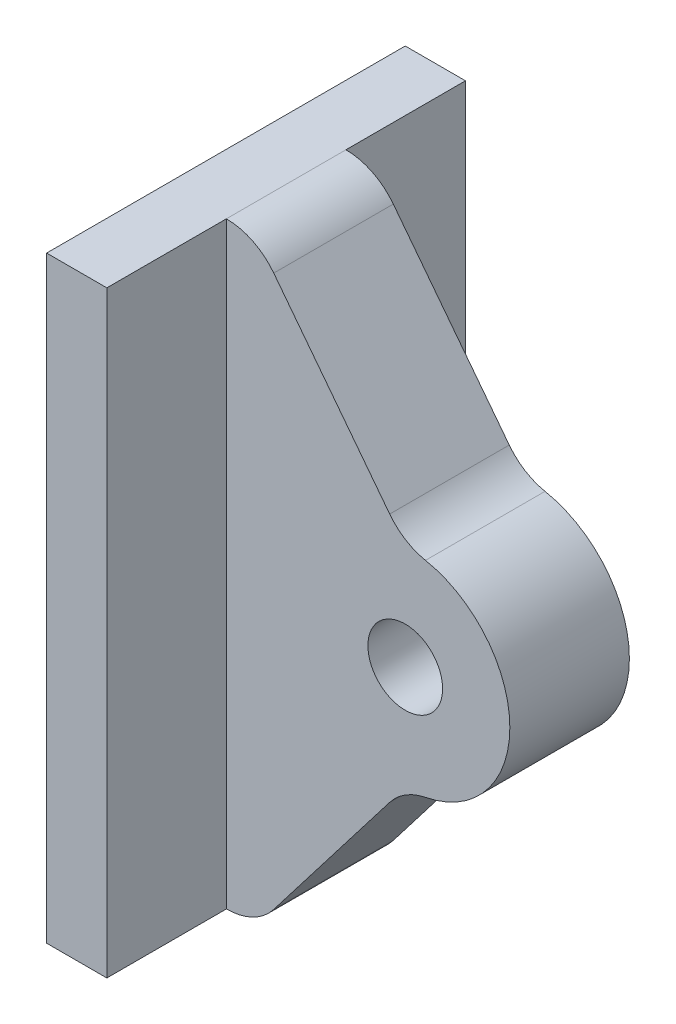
ISO-10303-21;
HEADER;
FILE_DESCRIPTION(('STEP AP214'),'2;1');
FILE_NAME('part.step','',(''),(''),'','','');
FILE_SCHEMA(('AUTOMOTIVE_DESIGN { 1 0 10303 214 1 1 1 1 }'));
ENDSEC;
DATA;
#1=APPLICATION_CONTEXT('core data for automotive mechanical design processes');
#2=APPLICATION_PROTOCOL_DEFINITION('international standard','automotive_design',2000,#1);
#3=PRODUCT_CONTEXT('',#1,'mechanical');
#4=PRODUCT('Part','Part','',(#3));
#5=PRODUCT_RELATED_PRODUCT_CATEGORY('part','',(#4));
#6=PRODUCT_DEFINITION_FORMATION('','',#4);
#7=PRODUCT_DEFINITION_CONTEXT('part definition',#1,'design');
#8=PRODUCT_DEFINITION('design','',#6,#7);
#9=PRODUCT_DEFINITION_SHAPE('','',#8);
#10=(LENGTH_UNIT() NAMED_UNIT(*) SI_UNIT(.MILLI.,.METRE.));
#11=(NAMED_UNIT(*) PLANE_ANGLE_UNIT() SI_UNIT($,.RADIAN.));
#12=(NAMED_UNIT(*) SI_UNIT($,.STERADIAN.) SOLID_ANGLE_UNIT());
#13=UNCERTAINTY_MEASURE_WITH_UNIT(LENGTH_MEASURE(1.E-05),#10,'distance_accuracy_value','');
#14=(GEOMETRIC_REPRESENTATION_CONTEXT(3) GLOBAL_UNCERTAINTY_ASSIGNED_CONTEXT((#13)) GLOBAL_UNIT_ASSIGNED_CONTEXT((#10,
#11,#12)) REPRESENTATION_CONTEXT('',''));
#15=CARTESIAN_POINT('',(0.,0.,0.));
#16=DIRECTION('',(0.,0.,1.));
#17=DIRECTION('',(1.,0.,0.));
#18=AXIS2_PLACEMENT_3D('',#15,#16,#17);
#19=CARTESIAN_POINT('',(-25.6327109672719,-147.759502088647,5.08));
#20=DIRECTION('',(0.,0.,-1.));
#21=DIRECTION('',(-1.,0.,0.));
#22=AXIS2_PLACEMENT_3D('',#19,#20,#21);
#23=PLANE('',#22);
#24=CARTESIAN_POINT('',(-26.9850770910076,-140.906668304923,5.08));
#25=DIRECTION('',(0.,0.,1.));
#26=DIRECTION('',(1.,0.,0.));
#27=AXIS2_PLACEMENT_3D('',#24,#25,#26);
#28=CIRCLE('',#27,1.5875000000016);
#29=CARTESIAN_POINT('',(-25.397577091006,-140.906668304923,5.08));
#30=VERTEX_POINT('',#29);
#31=EDGE_CURVE('E138',#30,#30,#28,.T.);
#32=ORIENTED_EDGE('',*,*,#31,.F.);
#33=EDGE_LOOP('',(#32));
#34=FACE_BOUND('',#33,.T.);
#35=DIRECTION('',(0.,1.,0.));
#36=VECTOR('',#35,1.);
#37=CARTESIAN_POINT('',(-34.5857768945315,-153.606668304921,5.08));
#38=LINE('',#37,#36);
#39=CARTESIAN_POINT('',(-34.5857768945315,-153.606668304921,5.08));
#40=VERTEX_POINT('',#39);
#41=CARTESIAN_POINT('',(-34.5857768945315,-128.206668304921,5.08));
#42=VERTEX_POINT('',#41);
#43=EDGE_CURVE('E103',#40,#42,#38,.T.);
#44=ORIENTED_EDGE('',*,*,#43,.F.);
#45=CARTESIAN_POINT('',(-34.5857768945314,-151.066668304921,5.08));
#46=DIRECTION('',(0.,0.,1.));
#47=DIRECTION('',(1.,0.,0.));
#48=AXIS2_PLACEMENT_3D('',#45,#46,#47);
#49=CIRCLE('',#48,2.53999999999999);
#50=CARTESIAN_POINT('',(-32.5725119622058,-152.61533363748,5.08));
#51=VERTEX_POINT('',#50);
#52=EDGE_CURVE('E106',#40,#51,#49,.T.);
#53=ORIENTED_EDGE('',*,*,#52,.T.);
#54=DIRECTION('',(0.609710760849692,0.7926239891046,0.));
#55=VECTOR('',#54,1.);
#56=CARTESIAN_POINT('',(-27.6459758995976,-146.210836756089,5.08));
#57=LINE('',#56,#55);
#58=CARTESIAN_POINT('',(-27.6459758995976,-146.210836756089,5.08));
#59=VERTEX_POINT('',#58);
#60=EDGE_CURVE('E48',#51,#59,#57,.T.);
#61=ORIENTED_EDGE('',*,*,#60,.T.);
#62=CARTESIAN_POINT('',(-25.6327109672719,-147.759502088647,5.08));
#63=DIRECTION('',(0.,0.,-1.));
#64=DIRECTION('',(-1.,0.,0.));
#65=AXIS2_PLACEMENT_3D('',#62,#63,#64);
#66=CIRCLE('',#65,2.53999999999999);
#67=CARTESIAN_POINT('',(-26.124480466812,-145.267562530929,5.08));
#68=VERTEX_POINT('',#67);
#69=EDGE_CURVE('E149',#59,#68,#66,.T.);
#70=ORIENTED_EDGE('',*,*,#69,.T.);
#71=CARTESIAN_POINT('',(-26.9850770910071,-140.906668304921,5.08));
#72=DIRECTION('',(0.,0.,1.));
#73=DIRECTION('',(1.,0.,0.));
#74=AXIS2_PLACEMENT_3D('',#71,#72,#73);
#75=CIRCLE('',#74,4.44499999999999);
#76=CARTESIAN_POINT('',(-26.124480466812,-136.545774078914,5.08));
#77=VERTEX_POINT('',#76);
#78=EDGE_CURVE('E89',#68,#77,#75,.T.);
#79=ORIENTED_EDGE('',*,*,#78,.T.);
#80=CARTESIAN_POINT('',(-25.6327109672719,-134.053834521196,5.08));
#81=DIRECTION('',(0.,0.,-1.));
#82=DIRECTION('',(1.,0.,0.));
#83=AXIS2_PLACEMENT_3D('',#80,#81,#82);
#84=CIRCLE('',#83,2.53999999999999);
#85=CARTESIAN_POINT('',(-27.6459758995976,-135.602499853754,5.08));
#86=VERTEX_POINT('',#85);
#87=EDGE_CURVE('E152',#77,#86,#84,.T.);
#88=ORIENTED_EDGE('',*,*,#87,.T.);
#89=DIRECTION('',(-0.609710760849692,0.7926239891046,0.));
#90=VECTOR('',#89,1.);
#91=CARTESIAN_POINT('',(-27.6459758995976,-135.602499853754,5.08));
#92=LINE('',#91,#90);
#93=CARTESIAN_POINT('',(-32.5725119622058,-129.198002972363,5.08));
#94=VERTEX_POINT('',#93);
#95=EDGE_CURVE('E154',#86,#94,#92,.T.);
#96=ORIENTED_EDGE('',*,*,#95,.T.);
#97=CARTESIAN_POINT('',(-34.5857768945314,-130.746668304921,5.08));
#98=DIRECTION('',(0.,0.,1.));
#99=DIRECTION('',(-1.,0.,0.));
#100=AXIS2_PLACEMENT_3D('',#97,#98,#99);
#101=CIRCLE('',#100,2.53999999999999);
#102=EDGE_CURVE('E108',#94,#42,#101,.T.);
#103=ORIENTED_EDGE('',*,*,#102,.T.);
#104=EDGE_LOOP('',(#44,#53,#61,#70,#79,#88,#96,#103));
#105=FACE_BOUND('',#104,.T.);
#106=ADVANCED_FACE('F31',(#34,#105),#23,.F.);
#107=CARTESIAN_POINT('',(-25.6327109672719,-147.759502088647,5.08));
#108=DIRECTION('',(0.,0.,-1.));
#109=DIRECTION('',(-1.,0.,0.));
#110=AXIS2_PLACEMENT_3D('',#107,#108,#109);
#111=CYLINDRICAL_SURFACE('',#110,2.53999999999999);
#112=CARTESIAN_POINT('',(-25.6327109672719,-147.759502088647,0.));
#113=DIRECTION('',(0.,0.,-1.));
#114=DIRECTION('',(-1.,0.,0.));
#115=AXIS2_PLACEMENT_3D('',#112,#113,#114);
#116=CIRCLE('',#115,2.53999999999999);
#117=CARTESIAN_POINT('',(-27.6459758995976,-146.210836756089,0.));
#118=VERTEX_POINT('',#117);
#119=CARTESIAN_POINT('',(-26.124480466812,-145.267562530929,0.));
#120=VERTEX_POINT('',#119);
#121=EDGE_CURVE('E147',#118,#120,#116,.T.);
#122=ORIENTED_EDGE('',*,*,#121,.T.);
#123=DIRECTION('',(0.,0.,-1.));
#124=VECTOR('',#123,1.);
#125=CARTESIAN_POINT('',(-26.124480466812,-145.267562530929,5.08));
#126=LINE('',#125,#124);
#127=EDGE_CURVE('E11',#68,#120,#126,.T.);
#128=ORIENTED_EDGE('',*,*,#127,.F.);
#129=ORIENTED_EDGE('',*,*,#69,.F.);
#130=DIRECTION('',(0.,0.,-1.));
#131=VECTOR('',#130,1.);
#132=CARTESIAN_POINT('',(-27.6459758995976,-146.210836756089,5.08));
#133=LINE('',#132,#131);
#134=EDGE_CURVE('E158',#59,#118,#133,.T.);
#135=ORIENTED_EDGE('',*,*,#134,.T.);
#136=EDGE_LOOP('',(#122,#128,#129,#135));
#137=FACE_BOUND('',#136,.T.);
#138=ADVANCED_FACE('F33',(#137),#111,.F.);
#139=CARTESIAN_POINT('',(-26.9850770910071,-140.906668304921,5.08));
#140=DIRECTION('',(0.,0.,-1.));
#141=DIRECTION('',(-1.,0.,0.));
#142=AXIS2_PLACEMENT_3D('',#139,#140,#141);
#143=CYLINDRICAL_SURFACE('',#142,4.44499999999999);
#144=CARTESIAN_POINT('',(-26.9850770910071,-140.906668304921,0.));
#145=DIRECTION('',(0.,0.,1.));
#146=DIRECTION('',(1.,0.,0.));
#147=AXIS2_PLACEMENT_3D('',#144,#145,#146);
#148=CIRCLE('',#147,4.44499999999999);
#149=CARTESIAN_POINT('',(-26.124480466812,-136.545774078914,0.));
#150=VERTEX_POINT('',#149);
#151=EDGE_CURVE('E161',#120,#150,#148,.T.);
#152=ORIENTED_EDGE('',*,*,#151,.T.);
#153=DIRECTION('',(0.,0.,-1.));
#154=VECTOR('',#153,1.);
#155=CARTESIAN_POINT('',(-26.124480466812,-136.545774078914,5.08));
#156=LINE('',#155,#154);
#157=EDGE_CURVE('E40',#77,#150,#156,.T.);
#158=ORIENTED_EDGE('',*,*,#157,.F.);
#159=ORIENTED_EDGE('',*,*,#78,.F.);
#160=ORIENTED_EDGE('',*,*,#127,.T.);
#161=EDGE_LOOP('',(#152,#158,#159,#160));
#162=FACE_BOUND('',#161,.T.);
#163=ADVANCED_FACE('F283',(#162),#143,.T.);
#164=CARTESIAN_POINT('',(-25.6327109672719,-134.053834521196,5.08));
#165=DIRECTION('',(0.,0.,-1.));
#166=DIRECTION('',(-1.,0.,0.));
#167=AXIS2_PLACEMENT_3D('',#164,#165,#166);
#168=CYLINDRICAL_SURFACE('',#167,2.53999999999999);
#169=CARTESIAN_POINT('',(-25.6327109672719,-134.053834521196,0.));
#170=DIRECTION('',(0.,0.,-1.));
#171=DIRECTION('',(1.,0.,0.));
#172=AXIS2_PLACEMENT_3D('',#169,#170,#171);
#173=CIRCLE('',#172,2.53999999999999);
#174=CARTESIAN_POINT('',(-27.6459758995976,-135.602499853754,0.));
#175=VERTEX_POINT('',#174);
#176=EDGE_CURVE('E163',#150,#175,#173,.T.);
#177=ORIENTED_EDGE('',*,*,#176,.T.);
#178=DIRECTION('',(0.,0.,-1.));
#179=VECTOR('',#178,1.);
#180=CARTESIAN_POINT('',(-27.6459758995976,-135.602499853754,5.08));
#181=LINE('',#180,#179);
#182=EDGE_CURVE('E184',#86,#175,#181,.T.);
#183=ORIENTED_EDGE('',*,*,#182,.F.);
#184=ORIENTED_EDGE('',*,*,#87,.F.);
#185=ORIENTED_EDGE('',*,*,#157,.T.);
#186=EDGE_LOOP('',(#177,#183,#184,#185));
#187=FACE_BOUND('',#186,.T.);
#188=ADVANCED_FACE('F190',(#187),#168,.F.);
#189=CARTESIAN_POINT('',(-27.6459758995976,-135.602499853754,5.08));
#190=DIRECTION('',(-0.7926239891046,-0.609710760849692,0.));
#191=DIRECTION('',(0.609710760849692,-0.7926239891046,0.));
#192=AXIS2_PLACEMENT_3D('',#189,#190,#191);
#193=PLANE('',#192);
#194=DIRECTION('',(-0.609710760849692,0.7926239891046,0.));
#195=VECTOR('',#194,1.);
#196=CARTESIAN_POINT('',(-27.6459758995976,-135.602499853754,0.));
#197=LINE('',#196,#195);
#198=CARTESIAN_POINT('',(-32.5725119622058,-129.198002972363,0.));
#199=VERTEX_POINT('',#198);
#200=EDGE_CURVE('E165',#175,#199,#197,.T.);
#201=ORIENTED_EDGE('',*,*,#200,.T.);
#202=DIRECTION('',(0.,0.,-1.));
#203=VECTOR('',#202,1.);
#204=CARTESIAN_POINT('',(-32.5725119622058,-129.198002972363,5.08));
#205=LINE('',#204,#203);
#206=EDGE_CURVE('E181',#94,#199,#205,.T.);
#207=ORIENTED_EDGE('',*,*,#206,.F.);
#208=ORIENTED_EDGE('',*,*,#95,.F.);
#209=ORIENTED_EDGE('',*,*,#182,.T.);
#210=EDGE_LOOP('',(#201,#207,#208,#209));
#211=FACE_BOUND('',#210,.T.);
#212=ADVANCED_FACE('F200',(#211),#193,.F.);
#213=CARTESIAN_POINT('',(-34.5857768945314,-130.746668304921,5.08));
#214=DIRECTION('',(0.,0.,-1.));
#215=DIRECTION('',(-1.,0.,0.));
#216=AXIS2_PLACEMENT_3D('',#213,#214,#215);
#217=CYLINDRICAL_SURFACE('',#216,2.53999999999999);
#218=CARTESIAN_POINT('',(-34.5857768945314,-130.746668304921,0.));
#219=DIRECTION('',(0.,0.,1.));
#220=DIRECTION('',(-1.,0.,0.));
#221=AXIS2_PLACEMENT_3D('',#218,#219,#220);
#222=CIRCLE('',#221,2.53999999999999);
#223=CARTESIAN_POINT('',(-34.5857768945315,-128.206668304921,0.));
#224=VERTEX_POINT('',#223);
#225=EDGE_CURVE('E167',#199,#224,#222,.T.);
#226=ORIENTED_EDGE('',*,*,#225,.T.);
#227=DIRECTION('',(0.,0.,-1.));
#228=VECTOR('',#227,1.);
#229=CARTESIAN_POINT('',(-34.5857768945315,-128.206668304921,5.08));
#230=LINE('',#229,#228);
#231=EDGE_CURVE('E178',#42,#224,#230,.T.);
#232=ORIENTED_EDGE('',*,*,#231,.F.);
#233=ORIENTED_EDGE('',*,*,#102,.F.);
#234=ORIENTED_EDGE('',*,*,#206,.T.);
#235=EDGE_LOOP('',(#226,#232,#233,#234));
#236=FACE_BOUND('',#235,.T.);
#237=ADVANCED_FACE('F203',(#236),#217,.T.);
#238=CARTESIAN_POINT('',(-34.5857768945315,-128.206668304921,5.08));
#239=DIRECTION('',(0.,-1.,0.));
#240=DIRECTION('',(0.,0.,-1.));
#241=AXIS2_PLACEMENT_3D('',#238,#239,#240);
#242=PLANE('',#241);
#243=ORIENTED_EDGE('',*,*,#231,.T.);
#244=DIRECTION('',(0.,0.,1.));
#245=VECTOR('',#244,1.);
#246=CARTESIAN_POINT('',(-34.5857768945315,-128.206668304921,-5.08));
#247=LINE('',#246,#245);
#248=CARTESIAN_POINT('',(-34.5857768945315,-128.206668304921,-5.08));
#249=VERTEX_POINT('',#248);
#250=EDGE_CURVE('E212',#249,#224,#247,.T.);
#251=ORIENTED_EDGE('',*,*,#250,.F.);
#252=DIRECTION('',(1.,0.,0.));
#253=VECTOR('',#252,1.);
#254=CARTESIAN_POINT('',(-34.5857768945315,-128.206668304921,-5.08));
#255=LINE('',#254,#253);
#256=CARTESIAN_POINT('',(-37.1450770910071,-128.206668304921,-5.08));
#257=VERTEX_POINT('',#256);
#258=EDGE_CURVE('E220',#257,#249,#255,.T.);
#259=ORIENTED_EDGE('',*,*,#258,.F.);
#260=DIRECTION('',(0.,0.,-1.));
#261=VECTOR('',#260,1.);
#262=CARTESIAN_POINT('',(-37.1450770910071,-128.206668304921,5.08));
#263=LINE('',#262,#261);
#264=CARTESIAN_POINT('',(-37.1450770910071,-128.206668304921,10.16));
#265=VERTEX_POINT('',#264);
#266=EDGE_CURVE('E175',#265,#257,#263,.T.);
#267=ORIENTED_EDGE('',*,*,#266,.F.);
#268=DIRECTION('',(-1.,0.,0.));
#269=VECTOR('',#268,1.);
#270=CARTESIAN_POINT('',(-34.5857768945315,-128.206668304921,10.16));
#271=LINE('',#270,#269);
#272=CARTESIAN_POINT('',(-34.5857768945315,-128.206668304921,10.16));
#273=VERTEX_POINT('',#272);
#274=EDGE_CURVE('E113',#273,#265,#271,.T.);
#275=ORIENTED_EDGE('',*,*,#274,.F.);
#276=DIRECTION('',(0.,0.,-1.));
#277=VECTOR('',#276,1.);
#278=CARTESIAN_POINT('',(-34.5857768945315,-128.206668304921,10.16));
#279=LINE('',#278,#277);
#280=EDGE_CURVE('E139',#273,#42,#279,.T.);
#281=ORIENTED_EDGE('',*,*,#280,.T.);
#282=EDGE_LOOP('',(#243,#251,#259,#267,#275,#281));
#283=FACE_BOUND('',#282,.T.);
#284=ADVANCED_FACE('F210',(#283),#242,.F.);
#285=CARTESIAN_POINT('',(-37.1450770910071,-153.606668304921,5.08));
#286=DIRECTION('',(1.,0.,0.));
#287=DIRECTION('',(0.,0.,-1.));
#288=AXIS2_PLACEMENT_3D('',#285,#286,#287);
#289=PLANE('',#288);
#290=ORIENTED_EDGE('',*,*,#266,.T.);
#291=DIRECTION('',(0.,1.,0.));
#292=VECTOR('',#291,1.);
#293=CARTESIAN_POINT('',(-37.1450770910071,-128.206668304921,-5.08));
#294=LINE('',#293,#292);
#295=CARTESIAN_POINT('',(-37.1450770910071,-153.606668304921,-5.08));
#296=VERTEX_POINT('',#295);
#297=EDGE_CURVE('E224',#296,#257,#294,.T.);
#298=ORIENTED_EDGE('',*,*,#297,.F.);
#299=DIRECTION('',(0.,0.,-1.));
#300=VECTOR('',#299,1.);
#301=CARTESIAN_POINT('',(-37.1450770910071,-153.606668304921,5.08));
#302=LINE('',#301,#300);
#303=CARTESIAN_POINT('',(-37.1450770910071,-153.606668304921,10.16));
#304=VERTEX_POINT('',#303);
#305=EDGE_CURVE('E130',#304,#296,#302,.T.);
#306=ORIENTED_EDGE('',*,*,#305,.F.);
#307=DIRECTION('',(0.,-1.,0.));
#308=VECTOR('',#307,1.);
#309=CARTESIAN_POINT('',(-37.1450770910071,-128.206668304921,10.16));
#310=LINE('',#309,#308);
#311=EDGE_CURVE('E230',#265,#304,#310,.T.);
#312=ORIENTED_EDGE('',*,*,#311,.F.);
#313=EDGE_LOOP('',(#290,#298,#306,#312));
#314=FACE_BOUND('',#313,.T.);
#315=ADVANCED_FACE('F247',(#314),#289,.F.);
#316=CARTESIAN_POINT('',(-34.5857768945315,-153.606668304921,5.08));
#317=DIRECTION('',(0.,1.,0.));
#318=DIRECTION('',(0.,0.,1.));
#319=AXIS2_PLACEMENT_3D('',#316,#317,#318);
#320=PLANE('',#319);
#321=ORIENTED_EDGE('',*,*,#305,.T.);
#322=DIRECTION('',(-1.,0.,0.));
#323=VECTOR('',#322,1.);
#324=CARTESIAN_POINT('',(-37.1450770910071,-153.606668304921,-5.08));
#325=LINE('',#324,#323);
#326=CARTESIAN_POINT('',(-34.5857768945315,-153.606668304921,-5.08));
#327=VERTEX_POINT('',#326);
#328=EDGE_CURVE('E252',#327,#296,#325,.T.);
#329=ORIENTED_EDGE('',*,*,#328,.F.);
#330=DIRECTION('',(0.,0.,1.));
#331=VECTOR('',#330,1.);
#332=CARTESIAN_POINT('',(-34.5857768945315,-153.606668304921,-5.08));
#333=LINE('',#332,#331);
#334=CARTESIAN_POINT('',(-34.5857768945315,-153.606668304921,0.));
#335=VERTEX_POINT('',#334);
#336=EDGE_CURVE('E114',#327,#335,#333,.T.);
#337=ORIENTED_EDGE('',*,*,#336,.T.);
#338=DIRECTION('',(0.,0.,-1.));
#339=VECTOR('',#338,1.);
#340=CARTESIAN_POINT('',(-34.5857768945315,-153.606668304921,5.08));
#341=LINE('',#340,#339);
#342=EDGE_CURVE('E119',#40,#335,#341,.T.);
#343=ORIENTED_EDGE('',*,*,#342,.F.);
#344=DIRECTION('',(0.,0.,-1.));
#345=VECTOR('',#344,1.);
#346=CARTESIAN_POINT('',(-34.5857768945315,-153.606668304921,10.16));
#347=LINE('',#346,#345);
#348=CARTESIAN_POINT('',(-34.5857768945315,-153.606668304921,10.16));
#349=VERTEX_POINT('',#348);
#350=EDGE_CURVE('E124',#349,#40,#347,.T.);
#351=ORIENTED_EDGE('',*,*,#350,.F.);
#352=DIRECTION('',(1.,0.,0.));
#353=VECTOR('',#352,1.);
#354=CARTESIAN_POINT('',(-37.1450770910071,-153.606668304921,10.16));
#355=LINE('',#354,#353);
#356=EDGE_CURVE('E233',#304,#349,#355,.T.);
#357=ORIENTED_EDGE('',*,*,#356,.F.);
#358=EDGE_LOOP('',(#321,#329,#337,#343,#351,#357));
#359=FACE_BOUND('',#358,.T.);
#360=ADVANCED_FACE('F121',(#359),#320,.F.);
#361=CARTESIAN_POINT('',(-34.5857768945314,-151.066668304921,5.08));
#362=DIRECTION('',(0.,0.,-1.));
#363=DIRECTION('',(-1.,0.,0.));
#364=AXIS2_PLACEMENT_3D('',#361,#362,#363);
#365=CYLINDRICAL_SURFACE('',#364,2.53999999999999);
#366=CARTESIAN_POINT('',(-34.5857768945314,-151.066668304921,0.));
#367=DIRECTION('',(0.,0.,1.));
#368=DIRECTION('',(1.,0.,0.));
#369=AXIS2_PLACEMENT_3D('',#366,#367,#368);
#370=CIRCLE('',#369,2.53999999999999);
#371=CARTESIAN_POINT('',(-32.5725119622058,-152.61533363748,0.));
#372=VERTEX_POINT('',#371);
#373=EDGE_CURVE('E75',#335,#372,#370,.T.);
#374=ORIENTED_EDGE('',*,*,#373,.T.);
#375=DIRECTION('',(0.,0.,-1.));
#376=VECTOR('',#375,1.);
#377=CARTESIAN_POINT('',(-32.5725119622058,-152.61533363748,5.08));
#378=LINE('',#377,#376);
#379=EDGE_CURVE('E131',#51,#372,#378,.T.);
#380=ORIENTED_EDGE('',*,*,#379,.F.);
#381=ORIENTED_EDGE('',*,*,#52,.F.);
#382=ORIENTED_EDGE('',*,*,#342,.T.);
#383=EDGE_LOOP('',(#374,#380,#381,#382));
#384=FACE_BOUND('',#383,.T.);
#385=ADVANCED_FACE('F133',(#384),#365,.T.);
#386=CARTESIAN_POINT('',(-27.6459758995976,-146.210836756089,5.08));
#387=DIRECTION('',(-0.7926239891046,0.609710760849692,0.));
#388=DIRECTION('',(-0.609710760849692,-0.7926239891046,0.));
#389=AXIS2_PLACEMENT_3D('',#386,#387,#388);
#390=PLANE('',#389);
#391=DIRECTION('',(0.609710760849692,0.7926239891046,0.));
#392=VECTOR('',#391,1.);
#393=CARTESIAN_POINT('',(-27.6459758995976,-146.210836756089,0.));
#394=LINE('',#393,#392);
#395=EDGE_CURVE('E81',#372,#118,#394,.T.);
#396=ORIENTED_EDGE('',*,*,#395,.T.);
#397=ORIENTED_EDGE('',*,*,#134,.F.);
#398=ORIENTED_EDGE('',*,*,#60,.F.);
#399=ORIENTED_EDGE('',*,*,#379,.T.);
#400=EDGE_LOOP('',(#396,#397,#398,#399));
#401=FACE_BOUND('',#400,.T.);
#402=ADVANCED_FACE('F267',(#401),#390,.F.);
#403=CARTESIAN_POINT('',(-25.6327109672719,-147.759502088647,0.));
#404=DIRECTION('',(0.,0.,-1.));
#405=DIRECTION('',(-1.,0.,0.));
#406=AXIS2_PLACEMENT_3D('',#403,#404,#405);
#407=PLANE('',#406);
#408=DIRECTION('',(0.,-1.,0.));
#409=VECTOR('',#408,1.);
#410=CARTESIAN_POINT('',(-34.5857768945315,-128.206668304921,0.));
#411=LINE('',#410,#409);
#412=EDGE_CURVE('E217',#224,#335,#411,.T.);
#413=ORIENTED_EDGE('',*,*,#412,.F.);
#414=ORIENTED_EDGE('',*,*,#225,.F.);
#415=ORIENTED_EDGE('',*,*,#200,.F.);
#416=ORIENTED_EDGE('',*,*,#176,.F.);
#417=ORIENTED_EDGE('',*,*,#151,.F.);
#418=ORIENTED_EDGE('',*,*,#121,.F.);
#419=ORIENTED_EDGE('',*,*,#395,.F.);
#420=ORIENTED_EDGE('',*,*,#373,.F.);
#421=EDGE_LOOP('',(#413,#414,#415,#416,#417,#418,#419,#420));
#422=FACE_BOUND('',#421,.T.);
#423=CARTESIAN_POINT('',(-26.9850770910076,-140.906668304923,0.));
#424=DIRECTION('',(0.,0.,1.));
#425=DIRECTION('',(1.,0.,0.));
#426=AXIS2_PLACEMENT_3D('',#423,#424,#425);
#427=CIRCLE('',#426,1.5875000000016);
#428=CARTESIAN_POINT('',(-25.397577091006,-140.906668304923,0.));
#429=VERTEX_POINT('',#428);
#430=EDGE_CURVE('E142',#429,#429,#427,.T.);
#431=ORIENTED_EDGE('',*,*,#430,.T.);
#432=EDGE_LOOP('',(#431));
#433=FACE_BOUND('',#432,.T.);
#434=ADVANCED_FACE('F194',(#422,#433),#407,.T.);
#435=CARTESIAN_POINT('',(-26.9850770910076,-140.906668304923,0.));
#436=DIRECTION('',(0.,0.,1.));
#437=DIRECTION('',(1.,0.,0.));
#438=AXIS2_PLACEMENT_3D('',#435,#436,#437);
#439=CYLINDRICAL_SURFACE('',#438,1.5875000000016);
#440=ORIENTED_EDGE('',*,*,#430,.F.);
#441=EDGE_LOOP('',(#440));
#442=FACE_BOUND('',#441,.T.);
#443=ORIENTED_EDGE('',*,*,#31,.T.);
#444=EDGE_LOOP('',(#443));
#445=FACE_BOUND('',#444,.T.);
#446=ADVANCED_FACE('F274',(#442,#445),#439,.F.);
#447=CARTESIAN_POINT('',(-34.5857768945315,-153.606668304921,10.16));
#448=DIRECTION('',(-1.,0.,0.));
#449=DIRECTION('',(0.,0.,1.));
#450=AXIS2_PLACEMENT_3D('',#447,#448,#449);
#451=PLANE('',#450);
#452=ORIENTED_EDGE('',*,*,#43,.T.);
#453=ORIENTED_EDGE('',*,*,#280,.F.);
#454=DIRECTION('',(0.,1.,0.));
#455=VECTOR('',#454,1.);
#456=CARTESIAN_POINT('',(-34.5857768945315,-153.606668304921,10.16));
#457=LINE('',#456,#455);
#458=EDGE_CURVE('E137',#349,#273,#457,.T.);
#459=ORIENTED_EDGE('',*,*,#458,.F.);
#460=ORIENTED_EDGE('',*,*,#350,.T.);
#461=EDGE_LOOP('',(#452,#453,#459,#460));
#462=FACE_BOUND('',#461,.T.);
#463=ADVANCED_FACE('F135',(#462),#451,.F.);
#464=CARTESIAN_POINT('',(-37.1450770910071,-128.206668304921,10.16));
#465=DIRECTION('',(0.,0.,1.));
#466=DIRECTION('',(1.,0.,0.));
#467=AXIS2_PLACEMENT_3D('',#464,#465,#466);
#468=PLANE('',#467);
#469=ORIENTED_EDGE('',*,*,#274,.T.);
#470=ORIENTED_EDGE('',*,*,#311,.T.);
#471=ORIENTED_EDGE('',*,*,#356,.T.);
#472=ORIENTED_EDGE('',*,*,#458,.T.);
#473=EDGE_LOOP('',(#469,#470,#471,#472));
#474=FACE_BOUND('',#473,.T.);
#475=ADVANCED_FACE('F237',(#474),#468,.T.);
#476=CARTESIAN_POINT('',(-34.5857768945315,-128.206668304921,-5.08));
#477=DIRECTION('',(-1.,0.,0.));
#478=DIRECTION('',(0.,0.,1.));
#479=AXIS2_PLACEMENT_3D('',#476,#477,#478);
#480=PLANE('',#479);
#481=ORIENTED_EDGE('',*,*,#412,.T.);
#482=ORIENTED_EDGE('',*,*,#336,.F.);
#483=DIRECTION('',(0.,-1.,0.));
#484=VECTOR('',#483,1.);
#485=CARTESIAN_POINT('',(-34.5857768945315,-128.206668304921,-5.08));
#486=LINE('',#485,#484);
#487=EDGE_CURVE('E219',#249,#327,#486,.T.);
#488=ORIENTED_EDGE('',*,*,#487,.F.);
#489=ORIENTED_EDGE('',*,*,#250,.T.);
#490=EDGE_LOOP('',(#481,#482,#488,#489));
#491=FACE_BOUND('',#490,.T.);
#492=ADVANCED_FACE('F216',(#491),#480,.F.);
#493=CARTESIAN_POINT('',(-34.5857768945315,-153.606668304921,-5.08));
#494=DIRECTION('',(0.,0.,1.));
#495=DIRECTION('',(1.,0.,0.));
#496=AXIS2_PLACEMENT_3D('',#493,#494,#495);
#497=PLANE('',#496);
#498=ORIENTED_EDGE('',*,*,#487,.T.);
#499=ORIENTED_EDGE('',*,*,#328,.T.);
#500=ORIENTED_EDGE('',*,*,#297,.T.);
#501=ORIENTED_EDGE('',*,*,#258,.T.);
#502=EDGE_LOOP('',(#498,#499,#500,#501));
#503=FACE_BOUND('',#502,.T.);
#504=ADVANCED_FACE('F255',(#503),#497,.F.);
#505=CLOSED_SHELL('',(#106,#138,#163,#188,#212,#237,#284,#315,#360,#385,#402,#434,#446,#463,
#475,#492,#504));
#506=MANIFOLD_SOLID_BREP('B2',#505);
#507=ADVANCED_BREP_SHAPE_REPRESENTATION('',(#18,#506),#14);
#508=SHAPE_DEFINITION_REPRESENTATION(#9,#507);
ENDSEC;
END-ISO-10303-21;
